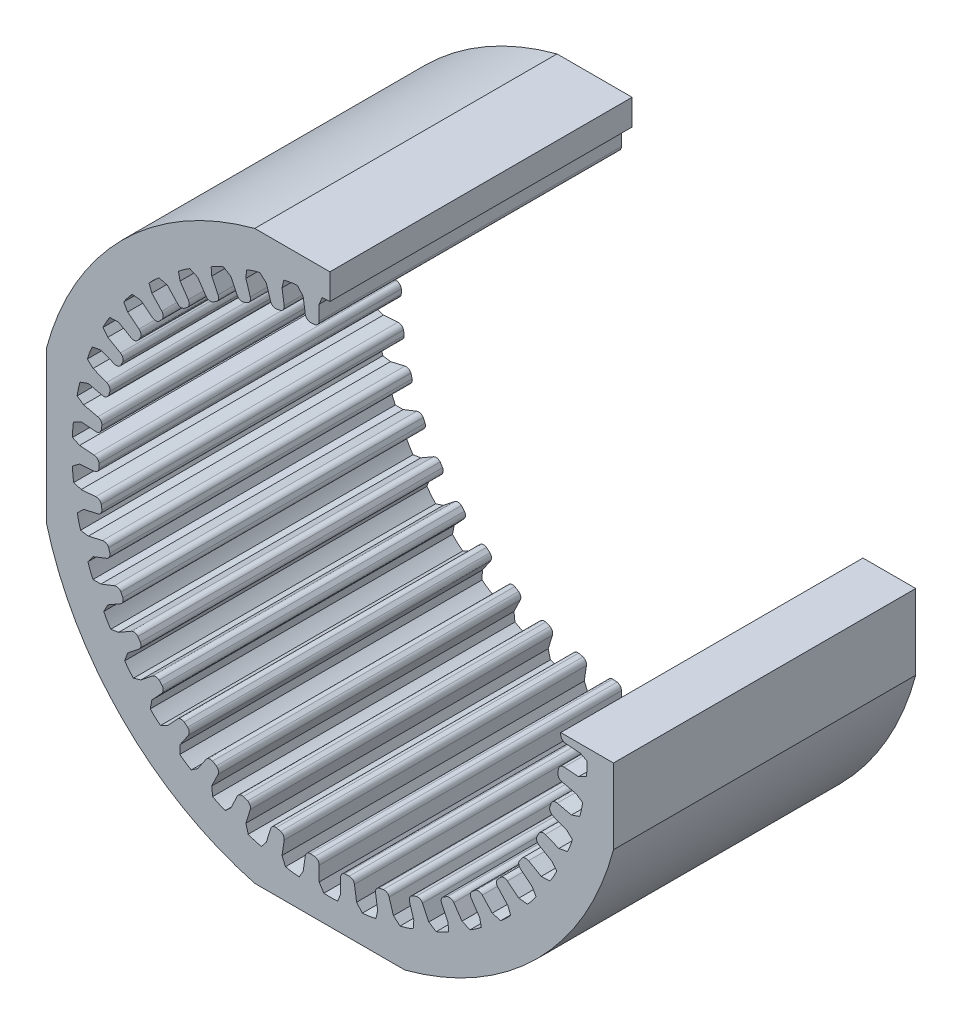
from build123d import *

# Parameters (mm, degrees)
EXTRUSION1_DEPTH        = 17
ENL_V_MAT_EXTRU_2_DEPTH = 29.24544211
ESQUISSE4_W             = 30.390329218
ESQUISSE4_H             = 17.000205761
ENL_V_MAT_EXTRU_3_DEPTH = 40


with BuildPart() as part:
    # Esquisse2 → Extrusion1 (new body)
    with BuildSketch(Plane.XY):
        with BuildLine():
            Line((15.95, 4.224630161), (15.95, -4.224630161))
            ThreePointArc((15.95, -4.224630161), (11.66726189, -11.66726189), (4.224630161, -15.95))
            Line((4.224630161, -15.95), (-4.224630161, -15.95))
            ThreePointArc((-4.224630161, -15.95), (-11.66726189, -11.66726189), (-15.95, -4.224630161))
            Line((-15.95, -4.224630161), (-15.95, 4.224630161))
            ThreePointArc((-15.95, 4.224630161), (-11.66726189, 11.66726189), (-4.224630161, 15.95))
            Line((-4.224630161, 15.95), (4.224630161, 15.95))
            ThreePointArc((4.224630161, 15.95), (11.66726189, 11.66726189), (15.95, 4.224630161))
        make_face()
    extrude(amount=EXTRUSION1_DEPTH)

    # Esquisse3 → Enl_v. mat.-Extru.2 (cut, through all)
    with BuildSketch(Plane.XY.offset(17)):
        with BuildLine():
            Line((-0.437557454, 14.47958796), (-0.6, 14.07104085))
            Line((-0.6, 14.07104085), (-0.6, 13.24999998))
            ThreePointArc((-0.6, 13.24999998), (-0.66832193, 13.059408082), (-0.842168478, 12.955626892))
            Line((-0.842168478, 12.955626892), (-1.094516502, 12.939148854))
            ThreePointArc((-1.094516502, 12.939148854), (-1.28437559, 13.014582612), (-1.381912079, 13.19409127))
            Line((-1.381912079, 13.19409127), (-1.503883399, 14.003318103))
            Line((-1.503883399, 14.003318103), (-1.824603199, 14.376426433))
            ThreePointArc((-1.824603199, 14.376426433), (-2.210231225, 14.33037769), (-2.590740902, 14.252648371))
            Line((-2.590740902, 14.252648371), (-2.690478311, 13.82445359))
            Line((-2.690478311, 13.82445359), (-2.56810852, 13.012583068))
            ThreePointArc((-2.56810852, 13.012583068), (-2.607261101, 12.813937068), (-2.763698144, 12.685404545))
            Line((-2.763698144, 12.685404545), (-3.010771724, 12.631500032))
            ThreePointArc((-3.010771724, 12.631500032), (-3.209753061, 12.677794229), (-3.332954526, 12.840760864))
            Line((-3.332954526, 12.840760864), (-3.574172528, 13.62277042))
            Line((-3.574172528, 13.62277042), (-3.946919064, 13.943910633))
            ThreePointArc((-3.946919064, 13.943910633), (-4.321376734, 13.840901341), (-4.686051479, 13.70732817))
            Line((-4.686051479, 13.70732817), (-4.720855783, 13.269050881))
            Line((-4.720855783, 13.269050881), (-4.478849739, 12.484486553))
            ThreePointArc((-4.478849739, 12.484486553), (-4.487958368, 12.282223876), (-4.62349136, 12.131811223))
            Line((-4.62349136, 12.131811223), (-4.859771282, 12.041684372))
            ThreePointArc((-4.859771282, 12.041684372), (-5.063429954, 12.057804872), (-5.209544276, 12.200589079))
            Line((-5.209544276, 12.200589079), (-5.564620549, 12.937912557))
            Line((-5.564620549, 12.937912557), (-5.981067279, 13.19991091))
            ThreePointArc((-5.981067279, 13.19991091), (-6.335989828, 13.042242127), (-6.676683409, 12.855808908))
            Line((-6.676683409, 12.855808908), (-6.645777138, 12.417239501))
            Line((-6.645777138, 12.417239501), (-6.289540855, 11.677507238))
            ThreePointArc((-6.289540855, 11.677507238), (-6.268402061, 11.476146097), (-6.380003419, 11.307213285))
            Line((-6.380003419, 11.307213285), (-6.600211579, 11.182877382))
            ThreePointArc((-6.600211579, 11.182877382), (-6.803998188, 11.168464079), (-6.969761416, 11.287876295))
            Line((-6.969761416, 11.287876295), (-7.430764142, 11.964043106))
            Line((-7.430764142, 11.964043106), (-7.881608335, 12.16104699))
            ThreePointArc((-7.881608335, 12.16104699), (-8.20906738, 11.952240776), (-8.518169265, 11.717112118))
            Line((-8.518169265, 11.717112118), (-8.422242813, 11.28804751))
            Line((-8.422242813, 11.28804751), (-7.959734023, 10.609671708))
            ThreePointArc((-7.959734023, 10.609671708), (-7.908820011, 10.413710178), (-7.993996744, 10.230030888))
            Line((-7.993996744, 10.230030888), (-8.193214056, 10.07426339))
            ThreePointArc((-8.193214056, 10.07426339), (-8.392576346, 10.029638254), (-8.574285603, 10.123011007))
            Line((-8.574285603, 10.123011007), (-9.130916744, 10.722916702))
            Line((-9.130916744, 10.722916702), (-9.606087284, 10.850525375))
            ThreePointArc((-9.606087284, 10.850525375), (-9.898767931, 10.595246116), (-10.169373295, 10.316674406))
            Line((-10.169373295, 10.316674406), (-10.010569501, 9.906699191))
            Line((-10.010569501, 9.906699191), (-9.452119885, 9.304833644))
            ThreePointArc((-9.452119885, 9.304833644), (-9.37256799, 9.118649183), (-9.429417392, 8.924326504))
            Line((-9.429417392, 8.924326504), (-9.603193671, 8.740607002))
            ThreePointArc((-9.603193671, 8.740607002), (-9.793678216, 8.666766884), (-9.987274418, 8.73201438))
            Line((-9.987274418, 8.73201438), (-10.627099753, 9.242258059))
            Line((-10.627099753, 9.242258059), (-11.115982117, 9.297620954))
            ThreePointArc((-11.115982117, 9.297620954), (-11.367346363, 9.001571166), (-11.593410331, 8.685779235))
            Line((-11.593410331, 8.685779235), (-11.375276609, 8.304051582))
            Line((-11.375276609, 8.304051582), (-10.733361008, 7.792140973))
            ThreePointArc((-10.733361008, 7.792140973), (-10.626948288, 7.619892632), (-10.654200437, 7.419267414))
            Line((-10.654200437, 7.419267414), (-10.798653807, 7.211699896))
            ThreePointArc((-10.798653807, 7.211699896), (-10.976005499, 7.110294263), (-11.177164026, 7.145958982))
            Line((-11.177164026, 7.145958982), (-11.885890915, 7.555142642))
            Line((-11.885890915, 7.555142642), (-12.377564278, 7.537023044))
            ThreePointArc((-12.377564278, 7.537023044), (-12.581997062, 7.206815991), (-12.758469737, 6.860858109))
            Line((-12.758469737, 6.860858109), (-12.485878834, 6.515905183))
            Line((-12.485878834, 6.515905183), (-11.774836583, 6.105384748))
            ThreePointArc((-11.774836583, 6.105384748), (-11.643940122, 5.950920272), (-11.640986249, 5.74847415))
            Line((-11.640986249, 5.74847415), (-11.752889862, 5.521695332))
            ThreePointArc((-11.752889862, 5.521695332), (-11.913146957, 5.394989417), (-12.117374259, 5.400274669))
            Line((-12.117374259, 5.400274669), (-12.879170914, 5.699257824))
            Line((-12.879170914, 5.699257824), (-13.362652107, 5.608060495))
            ThreePointArc((-13.362652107, 5.608060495), (-13.515586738, 5.251072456), (-13.638526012, 4.88267675))
            Line((-13.638526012, 4.88267675), (-13.317567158, 4.582204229))
            Line((-13.317567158, 4.582204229), (-12.553281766, 4.282244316))
            ThreePointArc((-12.553281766, 4.282244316), (-12.400825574, 4.149014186), (-12.367731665, 3.949269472))
            Line((-12.367731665, 3.949269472), (-12.444585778, 3.708345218))
            ThreePointArc((-12.444585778, 3.708345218), (-12.584168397, 3.559169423), (-12.786902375, 3.533957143))
            Line((-12.786902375, 3.533957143), (-13.584751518, 3.716061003))
            Line((-13.584751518, 3.716061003), (-14.049240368, 3.55382314))
            ThreePointArc((-14.049240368, 3.55382314), (-14.147260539, 3.178028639), (-14.213920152, 2.795424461))
            Line((-14.213920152, 2.795424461), (-13.851763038, 2.546144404))
            Line((-13.851763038, 2.546144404), (-13.051307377, 2.363445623))
            ThreePointArc((-13.051307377, 2.363445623), (-12.880697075, 2.25442598), (-12.818202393, 2.06184464))
            Line((-12.818202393, 2.06184464), (-12.858290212, 1.8121568))
            ThreePointArc((-12.858290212, 1.8121568), (-12.97408031, 1.643843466), (-13.170792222, 1.588696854))
            Line((-13.170792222, 1.588696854), (-13.986871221, 1.64985352))
            Line((-13.986871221, 1.64985352), (-14.421991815, 1.42019925))
            ThreePointArc((-14.421991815, 1.42019925), (-14.462907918, 1.033992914), (-14.471798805, 0.645727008))
            Line((-14.471798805, 0.645727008), (-14.076533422, 0.453207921))
            Line((-14.076533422, 0.453207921), (-13.257788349, 0.39185146))
            ThreePointArc((-13.257788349, 0.39185146), (-13.072835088, 0.309477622), (-12.982335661, 0.128361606))
            Line((-12.982335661, 0.128361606), (-12.98476169, -0.124512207))
            ThreePointArc((-12.98476169, -0.124512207), (-13.074172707, -0.308203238), (-13.260468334, -0.392052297))
            Line((-13.260468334, -0.392052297), (-14.076547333, -0.453208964))
            Line((-14.076547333, -0.453208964), (-14.472579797, -0.745149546))
            ThreePointArc((-14.472579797, -0.745149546), (-14.455477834, -1.133140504), (-14.406401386, -1.518394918))
            Line((-14.406401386, -1.518394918), (-13.98685731, -1.649852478))
            Line((-13.98685731, -1.649852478), (-13.168112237, -1.588496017))
            ThreePointArc((-13.168112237, -1.588496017), (-12.972947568, -1.642383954), (-12.856465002, -1.807988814))
            Line((-12.856465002, -1.807988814), (-12.821175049, -2.058399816))
            ThreePointArc((-12.821175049, -2.058399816), (-12.882209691, -2.253365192), (-13.053927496, -2.364043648))
            Line((-13.053927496, -2.364043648), (-13.851776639, -2.546147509))
            Line((-13.851776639, -2.546147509), (-14.199874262, -2.893852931))
            ThreePointArc((-14.199874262, -2.893852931), (-14.125136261, -3.274961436), (-14.019188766, -3.648598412))
            Line((-14.019188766, -3.648598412), (-13.584737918, -3.716057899))
            Line((-13.584737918, -3.716057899), (-12.784282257, -3.533359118))
            ThreePointArc((-12.784282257, -3.533359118), (-12.583265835, -3.557557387), (-12.44340216, -3.703951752))
            Line((-12.44340216, -3.703951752), (-12.371184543, -3.946306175))
            ThreePointArc((-12.371184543, -3.946306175), (-12.402479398, -4.14819069), (-12.555783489, -4.28322617))
            Line((-12.555783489, -4.28322617), (-13.317580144, -4.582209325))
            Line((-13.317580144, -4.582209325), (-13.609966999, -4.977912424))
            ThreePointArc((-13.609966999, -4.977912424), (-13.479262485, -5.343625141), (-13.318810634, -5.697298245))
            Line((-13.318810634, -5.697298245), (-12.879157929, -5.699252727))
            Line((-12.879157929, -5.699252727), (-12.114872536, -5.399292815))
            ThreePointArc((-12.114872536, -5.399292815), (-11.912494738, -5.393260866), (-11.752374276, -5.517174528))
            Line((-11.752374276, -5.517174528), (-11.644842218, -5.746058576))
            ThreePointArc((-11.644842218, -5.746058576), (-11.64569821, -5.950352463), (-11.777164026, -6.106728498))
            Line((-11.777164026, -6.106728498), (-12.485890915, -6.515912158))
            Line((-12.485890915, -6.515912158), (-12.716035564, -6.95077358))
            ThreePointArc((-12.716035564, -6.95077358), (-12.53228426, -7.292921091), (-12.320912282, -7.618729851))
            Line((-12.320912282, -7.618729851), (-11.885878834, -7.555135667))
            Line((-11.885878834, -7.555135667), (-11.174836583, -7.144615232))
            ThreePointArc((-11.174836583, -7.144615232), (-10.975618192, -7.10848781), (-10.798817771, -7.207152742))
            Line((-10.798817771, -7.207152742), (-10.65837336, -7.417453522))
            ThreePointArc((-10.65837336, -7.417453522), (-10.628771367, -7.619593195), (-10.73546218, -7.793816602))
            Line((-10.73546218, -7.793816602), (-11.375287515, -8.30406028))
            Line((-11.375287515, -8.30406028), (-11.538048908, -8.768365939))
            ThreePointArc((-11.538048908, -8.768365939), (-11.305355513, -9.079305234), (-11.04778511, -9.369971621))
            Line((-11.04778511, -9.369971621), (-10.627088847, -9.242249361))
            Line((-10.627088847, -9.242249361), (-9.985173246, -8.730338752))
            ThreePointArc((-9.985173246, -8.730338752), (-9.793564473, -8.664922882), (-9.604033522, -8.736135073))
            Line((-9.604033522, -8.736135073), (-9.433814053, -8.923154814))
            ThreePointArc((-9.433814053, -8.923154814), (-9.374415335, -9.118624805), (-9.453947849, -9.306803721))
            Line((-9.453947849, -9.306803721), (-10.01057899, -9.906709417))
            Line((-10.01057899, -9.906709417), (-10.102321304, -10.390087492))
            ThreePointArc((-10.102321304, -10.390087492), (-9.825883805, -10.662872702), (-9.527868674, -10.911903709))
            Line((-9.527868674, -10.911903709), (-9.130907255, -10.722906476))
            Line((-9.130907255, -10.722906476), (-8.572457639, -10.12104093))
            ThreePointArc((-8.572457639, -10.12104093), (-8.392738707, -10.027797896), (-8.194711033, -10.069966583))
            Line((-8.194711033, -10.069966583), (-7.99851893, -10.229527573))
            ThreePointArc((-7.99851893, -10.229527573), (-7.910650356, -10.413961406), (-7.961247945, -10.611892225))
            Line((-7.961247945, -10.611892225), (-8.422250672, -11.288059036))
            Line((-8.422250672, -11.288059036), (-8.440924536, -11.779711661))
            ThreePointArc((-8.440924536, -11.779711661), (-8.12691809, -12.008249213), (-7.795115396, -12.210081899))
            Line((-7.795115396, -12.210081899), (-7.430756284, -11.96403158))
            Line((-7.430756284, -11.96403158), (-6.968247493, -11.285655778))
            ThreePointArc((-6.968247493, -11.285655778), (-6.804433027, -11.166668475), (-6.602332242, -11.17885168))
            Line((-6.602332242, -11.17885168), (-6.384550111, -11.307389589))
            ThreePointArc((-6.384550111, -11.307389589), (-6.27017452, -11.476667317), (-6.290706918, -11.679928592))
            Line((-6.290706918, -11.679928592), (-6.645783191, -12.41725207))
            Line((-6.645783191, -12.41725207), (-6.590971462, -12.906196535))
            ThreePointArc((-6.590971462, -12.906196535), (-6.246410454, -13.08538128), (-5.888232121, -13.235507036))
            Line((-5.888232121, -13.235507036), (-5.564614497, -12.937899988))
            Line((-5.564614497, -12.937899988), (-5.208378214, -12.198167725))
            ThreePointArc((-5.208378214, -12.198167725), (-5.064127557, -12.056094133), (-4.862468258, -12.038019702))
            Line((-4.862468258, -12.038019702), (-4.627960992, -12.132663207))
            ThreePointArc((-4.627960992, -12.132663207), (-4.489633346, -12.283003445), (-4.479641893, -12.487054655))
            Line((-4.479641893, -12.487054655), (-4.720859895, -13.269064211))
            Line((-4.720859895, -13.269064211), (-4.593786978, -13.744378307))
            ThreePointArc((-4.593786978, -13.744378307), (-4.22636833, -13.870207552), (-3.84981547, -13.965272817))
            Line((-3.84981547, -13.965272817), (-3.574168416, -13.62275709))
            Line((-3.574168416, -13.62275709), (-3.332162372, -12.838192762))
            ThreePointArc((-3.332162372, -12.838192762), (-3.210697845, -12.676206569), (-3.013984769, -12.628278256))
            Line((-3.013984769, -12.628278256), (-2.767990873, -12.686913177))
            ThreePointArc((-2.767990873, -12.686913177), (-2.608801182, -12.814957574), (-2.568509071, -13.015240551))
            Line((-2.568509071, -13.015240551), (-2.690480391, -13.824467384))
            Line((-2.690480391, -13.824467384), (-2.493984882, -14.275533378))
            ThreePointArc((-2.493984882, -14.275533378), (-2.111916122, -14.345196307), (-1.725400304, -14.38307748))
            Line((-1.725400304, -14.38307748), (-1.50388132, -14.003304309))
            Line((-1.50388132, -14.003304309), (-1.381511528, -13.191433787))
            ThreePointArc((-1.381511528, -13.191433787), (-1.28554645, -13.013153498), (-1.09817384, -12.936441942))
            Line((-1.09817384, -12.936441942), (-0.846188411, -12.957758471))
            ThreePointArc((-0.846188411, -12.957758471), (-0.66969271, -13.060646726), (-0.6, -13.25268748))
            Line((-0.6, -13.25268748), (-0.6, -14.0710548))
            Line((-0.6, -14.0710548), (-0.338471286, -14.487796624))
            ThreePointArc((-0.338471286, -14.487796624), (0.049712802, -14.499737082), (0.437557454, -14.47958796))
            Line((0.437557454, -14.47958796), (0.6, -14.07104085))
            Line((0.6, -14.07104085), (0.6, -13.24999998))
            ThreePointArc((0.6, -13.24999998), (0.66832193, -13.059408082), (0.842168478, -12.955626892))
            Line((0.842168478, -12.955626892), (1.094516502, -12.939148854))
            ThreePointArc((1.094516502, -12.939148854), (1.28437559, -13.014582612), (1.381912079, -13.19409127))
            Line((1.381912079, -13.19409127), (1.503883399, -14.003318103))
            Line((1.503883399, -14.003318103), (1.824603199, -14.376426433))
            ThreePointArc((1.824603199, -14.376426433), (2.210231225, -14.33037769), (2.590740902, -14.252648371))
            Line((2.590740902, -14.252648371), (2.690478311, -13.82445359))
            Line((2.690478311, -13.82445359), (2.56810852, -13.012583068))
            ThreePointArc((2.56810852, -13.012583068), (2.607261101, -12.813937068), (2.763698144, -12.685404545))
            Line((2.763698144, -12.685404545), (3.010771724, -12.631500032))
            ThreePointArc((3.010771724, -12.631500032), (3.209753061, -12.677794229), (3.332954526, -12.840760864))
            Line((3.332954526, -12.840760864), (3.574172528, -13.62277042))
            Line((3.574172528, -13.62277042), (3.946919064, -13.943910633))
            ThreePointArc((3.946919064, -13.943910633), (4.321376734, -13.840901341), (4.686051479, -13.70732817))
            Line((4.686051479, -13.70732817), (4.720855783, -13.269050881))
            Line((4.720855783, -13.269050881), (4.478849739, -12.484486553))
            ThreePointArc((4.478849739, -12.484486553), (4.487958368, -12.282223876), (4.62349136, -12.131811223))
            Line((4.62349136, -12.131811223), (4.859771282, -12.041684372))
            ThreePointArc((4.859771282, -12.041684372), (5.063429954, -12.057804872), (5.209544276, -12.200589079))
            Line((5.209544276, -12.200589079), (5.564620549, -12.937912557))
            Line((5.564620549, -12.937912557), (5.981067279, -13.19991091))
            ThreePointArc((5.981067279, -13.19991091), (6.335989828, -13.042242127), (6.676683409, -12.855808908))
            Line((6.676683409, -12.855808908), (6.645777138, -12.417239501))
            Line((6.645777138, -12.417239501), (6.289540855, -11.677507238))
            ThreePointArc((6.289540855, -11.677507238), (6.268402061, -11.476146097), (6.380003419, -11.307213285))
            Line((6.380003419, -11.307213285), (6.600211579, -11.182877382))
            ThreePointArc((6.600211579, -11.182877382), (6.803998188, -11.168464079), (6.969761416, -11.287876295))
            Line((6.969761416, -11.287876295), (7.430764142, -11.964043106))
            Line((7.430764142, -11.964043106), (7.881608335, -12.16104699))
            ThreePointArc((7.881608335, -12.16104699), (8.20906738, -11.952240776), (8.518169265, -11.717112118))
            Line((8.518169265, -11.717112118), (8.422242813, -11.28804751))
            Line((8.422242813, -11.28804751), (7.959734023, -10.609671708))
            ThreePointArc((7.959734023, -10.609671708), (7.908820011, -10.413710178), (7.993996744, -10.230030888))
            Line((7.993996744, -10.230030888), (8.193214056, -10.07426339))
            ThreePointArc((8.193214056, -10.07426339), (8.392576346, -10.029638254), (8.574285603, -10.123011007))
            Line((8.574285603, -10.123011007), (9.130916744, -10.722916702))
            Line((9.130916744, -10.722916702), (9.606087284, -10.850525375))
            ThreePointArc((9.606087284, -10.850525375), (9.898767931, -10.595246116), (10.169373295, -10.316674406))
            Line((10.169373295, -10.316674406), (10.010569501, -9.906699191))
            Line((10.010569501, -9.906699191), (9.452119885, -9.304833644))
            ThreePointArc((9.452119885, -9.304833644), (9.37256799, -9.118649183), (9.429417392, -8.924326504))
            Line((9.429417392, -8.924326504), (9.603193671, -8.740607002))
            ThreePointArc((9.603193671, -8.740607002), (9.793678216, -8.666766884), (9.987274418, -8.73201438))
            Line((9.987274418, -8.73201438), (10.627099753, -9.242258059))
            Line((10.627099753, -9.242258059), (11.115982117, -9.297620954))
            ThreePointArc((11.115982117, -9.297620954), (11.367346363, -9.001571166), (11.593410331, -8.685779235))
            Line((11.593410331, -8.685779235), (11.375276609, -8.304051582))
            Line((11.375276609, -8.304051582), (10.733361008, -7.792140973))
            ThreePointArc((10.733361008, -7.792140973), (10.626948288, -7.619892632), (10.654200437, -7.419267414))
            Line((10.654200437, -7.419267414), (10.798653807, -7.211699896))
            ThreePointArc((10.798653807, -7.211699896), (10.976005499, -7.110294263), (11.177164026, -7.145958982))
            Line((11.177164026, -7.145958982), (11.885890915, -7.555142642))
            Line((11.885890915, -7.555142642), (12.377564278, -7.537023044))
            ThreePointArc((12.377564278, -7.537023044), (12.581997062, -7.206815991), (12.758469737, -6.860858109))
            Line((12.758469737, -6.860858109), (12.485878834, -6.515905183))
            Line((12.485878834, -6.515905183), (11.774836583, -6.105384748))
            ThreePointArc((11.774836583, -6.105384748), (11.643940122, -5.950920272), (11.640986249, -5.74847415))
            Line((11.640986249, -5.74847415), (11.752889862, -5.521695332))
            ThreePointArc((11.752889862, -5.521695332), (11.913146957, -5.394989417), (12.117374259, -5.400274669))
            Line((12.117374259, -5.400274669), (12.879170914, -5.699257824))
            Line((12.879170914, -5.699257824), (13.362652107, -5.608060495))
            ThreePointArc((13.362652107, -5.608060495), (13.515586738, -5.251072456), (13.638526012, -4.88267675))
            Line((13.638526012, -4.88267675), (13.317567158, -4.582204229))
            Line((13.317567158, -4.582204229), (12.553281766, -4.282244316))
            ThreePointArc((12.553281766, -4.282244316), (12.400825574, -4.149014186), (12.367731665, -3.949269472))
            Line((12.367731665, -3.949269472), (12.444585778, -3.708345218))
            ThreePointArc((12.444585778, -3.708345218), (12.584168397, -3.559169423), (12.786902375, -3.533957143))
            Line((12.786902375, -3.533957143), (13.584751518, -3.716061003))
            Line((13.584751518, -3.716061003), (14.049240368, -3.55382314))
            ThreePointArc((14.049240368, -3.55382314), (14.147260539, -3.178028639), (14.213920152, -2.795424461))
            Line((14.213920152, -2.795424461), (13.851763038, -2.546144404))
            Line((13.851763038, -2.546144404), (13.051307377, -2.363445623))
            ThreePointArc((13.051307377, -2.363445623), (12.880697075, -2.25442598), (12.818202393, -2.06184464))
            Line((12.818202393, -2.06184464), (12.858290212, -1.8121568))
            ThreePointArc((12.858290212, -1.8121568), (12.97408031, -1.643843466), (13.170792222, -1.588696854))
            Line((13.170792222, -1.588696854), (13.986871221, -1.64985352))
            Line((13.986871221, -1.64985352), (14.421991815, -1.42019925))
            ThreePointArc((14.421991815, -1.42019925), (14.462907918, -1.033992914), (14.471798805, -0.645727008))
            Line((14.471798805, -0.645727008), (14.076533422, -0.453207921))
            Line((14.076533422, -0.453207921), (13.257788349, -0.39185146))
            ThreePointArc((13.257788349, -0.39185146), (13.072835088, -0.309477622), (12.982335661, -0.128361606))
            Line((12.982335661, -0.128361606), (12.98476169, 0.124512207))
            ThreePointArc((12.98476169, 0.124512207), (13.074172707, 0.308203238), (13.260468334, 0.392052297))
            Line((13.260468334, 0.392052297), (14.076547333, 0.453208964))
            Line((14.076547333, 0.453208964), (14.472579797, 0.745149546))
            ThreePointArc((14.472579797, 0.745149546), (14.455477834, 1.133140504), (14.406401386, 1.518394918))
            Line((14.406401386, 1.518394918), (13.98685731, 1.649852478))
            Line((13.98685731, 1.649852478), (13.168112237, 1.588496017))
            ThreePointArc((13.168112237, 1.588496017), (12.972947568, 1.642383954), (12.856465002, 1.807988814))
            Line((12.856465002, 1.807988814), (12.821175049, 2.058399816))
            ThreePointArc((12.821175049, 2.058399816), (12.882209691, 2.253365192), (13.053927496, 2.364043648))
            Line((13.053927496, 2.364043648), (13.851776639, 2.546147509))
            Line((13.851776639, 2.546147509), (14.199874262, 2.893852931))
            ThreePointArc((14.199874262, 2.893852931), (14.125136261, 3.274961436), (14.019188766, 3.648598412))
            Line((14.019188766, 3.648598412), (13.584737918, 3.716057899))
            Line((13.584737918, 3.716057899), (12.784282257, 3.533359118))
            ThreePointArc((12.784282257, 3.533359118), (12.583265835, 3.557557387), (12.44340216, 3.703951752))
            Line((12.44340216, 3.703951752), (12.371184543, 3.946306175))
            ThreePointArc((12.371184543, 3.946306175), (12.402479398, 4.14819069), (12.555783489, 4.28322617))
            Line((12.555783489, 4.28322617), (13.317580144, 4.582209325))
            Line((13.317580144, 4.582209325), (13.609966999, 4.977912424))
            ThreePointArc((13.609966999, 4.977912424), (13.479262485, 5.343625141), (13.318810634, 5.697298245))
            Line((13.318810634, 5.697298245), (12.879157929, 5.699252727))
            Line((12.879157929, 5.699252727), (12.114872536, 5.399292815))
            ThreePointArc((12.114872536, 5.399292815), (11.912494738, 5.393260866), (11.752374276, 5.517174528))
            Line((11.752374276, 5.517174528), (11.644842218, 5.746058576))
            ThreePointArc((11.644842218, 5.746058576), (11.64569821, 5.950352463), (11.777164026, 6.106728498))
            Line((11.777164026, 6.106728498), (12.485890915, 6.515912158))
            Line((12.485890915, 6.515912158), (12.716035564, 6.95077358))
            ThreePointArc((12.716035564, 6.95077358), (12.53228426, 7.292921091), (12.320912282, 7.618729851))
            Line((12.320912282, 7.618729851), (11.885878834, 7.555135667))
            Line((11.885878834, 7.555135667), (11.174836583, 7.144615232))
            ThreePointArc((11.174836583, 7.144615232), (10.975618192, 7.10848781), (10.798817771, 7.207152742))
            Line((10.798817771, 7.207152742), (10.65837336, 7.417453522))
            ThreePointArc((10.65837336, 7.417453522), (10.628771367, 7.619593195), (10.73546218, 7.793816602))
            Line((10.73546218, 7.793816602), (11.375287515, 8.30406028))
            Line((11.375287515, 8.30406028), (11.538048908, 8.768365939))
            ThreePointArc((11.538048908, 8.768365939), (11.305355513, 9.079305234), (11.04778511, 9.369971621))
            Line((11.04778511, 9.369971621), (10.627088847, 9.242249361))
            Line((10.627088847, 9.242249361), (9.985173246, 8.730338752))
            ThreePointArc((9.985173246, 8.730338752), (9.793564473, 8.664922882), (9.604033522, 8.736135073))
            Line((9.604033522, 8.736135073), (9.433814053, 8.923154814))
            ThreePointArc((9.433814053, 8.923154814), (9.374415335, 9.118624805), (9.453947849, 9.306803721))
            Line((9.453947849, 9.306803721), (10.01057899, 9.906709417))
            Line((10.01057899, 9.906709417), (10.102321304, 10.390087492))
            ThreePointArc((10.102321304, 10.390087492), (9.825883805, 10.662872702), (9.527868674, 10.911903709))
            Line((9.527868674, 10.911903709), (9.130907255, 10.722906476))
            Line((9.130907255, 10.722906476), (8.572457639, 10.12104093))
            ThreePointArc((8.572457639, 10.12104093), (8.392738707, 10.027797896), (8.194711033, 10.069966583))
            Line((8.194711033, 10.069966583), (7.99851893, 10.229527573))
            ThreePointArc((7.99851893, 10.229527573), (7.910650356, 10.413961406), (7.961247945, 10.611892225))
            Line((7.961247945, 10.611892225), (8.422250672, 11.288059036))
            Line((8.422250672, 11.288059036), (8.440924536, 11.779711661))
            ThreePointArc((8.440924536, 11.779711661), (8.12691809, 12.008249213), (7.795115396, 12.210081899))
            Line((7.795115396, 12.210081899), (7.430756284, 11.96403158))
            Line((7.430756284, 11.96403158), (6.968247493, 11.285655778))
            ThreePointArc((6.968247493, 11.285655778), (6.804433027, 11.166668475), (6.602332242, 11.17885168))
            Line((6.602332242, 11.17885168), (6.384550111, 11.307389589))
            ThreePointArc((6.384550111, 11.307389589), (6.27017452, 11.476667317), (6.290706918, 11.679928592))
            Line((6.290706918, 11.679928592), (6.645783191, 12.41725207))
            Line((6.645783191, 12.41725207), (6.590971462, 12.906196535))
            ThreePointArc((6.590971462, 12.906196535), (6.246410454, 13.08538128), (5.888232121, 13.235507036))
            Line((5.888232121, 13.235507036), (5.564614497, 12.937899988))
            Line((5.564614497, 12.937899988), (5.208378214, 12.198167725))
            ThreePointArc((5.208378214, 12.198167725), (5.064127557, 12.056094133), (4.862468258, 12.038019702))
            Line((4.862468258, 12.038019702), (4.627960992, 12.132663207))
            ThreePointArc((4.627960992, 12.132663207), (4.489633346, 12.283003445), (4.479641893, 12.487054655))
            Line((4.479641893, 12.487054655), (4.720859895, 13.269064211))
            Line((4.720859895, 13.269064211), (4.593786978, 13.744378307))
            ThreePointArc((4.593786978, 13.744378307), (4.22636833, 13.870207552), (3.84981547, 13.965272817))
            Line((3.84981547, 13.965272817), (3.574168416, 13.62275709))
            Line((3.574168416, 13.62275709), (3.332162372, 12.838192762))
            ThreePointArc((3.332162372, 12.838192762), (3.210697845, 12.676206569), (3.013984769, 12.628278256))
            Line((3.013984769, 12.628278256), (2.767990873, 12.686913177))
            ThreePointArc((2.767990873, 12.686913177), (2.608801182, 12.814957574), (2.568509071, 13.015240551))
            Line((2.568509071, 13.015240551), (2.690480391, 13.824467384))
            Line((2.690480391, 13.824467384), (2.493984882, 14.275533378))
            ThreePointArc((2.493984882, 14.275533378), (2.111916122, 14.345196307), (1.725400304, 14.38307748))
            Line((1.725400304, 14.38307748), (1.50388132, 14.003304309))
            Line((1.50388132, 14.003304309), (1.381511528, 13.191433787))
            ThreePointArc((1.381511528, 13.191433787), (1.28554645, 13.013153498), (1.09817384, 12.936441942))
            Line((1.09817384, 12.936441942), (0.846188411, 12.957758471))
            ThreePointArc((0.846188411, 12.957758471), (0.66969271, 13.060646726), (0.6, 13.25268748))
            Line((0.6, 13.25268748), (0.6, 14.0710548))
            Line((0.6, 14.0710548), (0.338471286, 14.487796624))
            ThreePointArc((0.338471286, 14.487796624), (-0.049712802, 14.499737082), (-0.437557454, 14.47958796))
        make_face()
    extrude(amount=-ENL_V_MAT_EXTRU_2_DEPTH, mode=Mode.SUBTRACT)

    # Esquisse4 → Enl_v. mat.-Extru.3 (cut)
    with BuildSketch(Plane(origin=(0, 0, 0), x_dir=(0, 0, -1), z_dir=(1, 0, 0))):
        with Locations((-7.351337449, 8.500102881)):
            Rectangle(ESQUISSE4_W, ESQUISSE4_H)
    extrude(amount=ENL_V_MAT_EXTRU_3_DEPTH, mode=Mode.SUBTRACT)


solid = part.part
